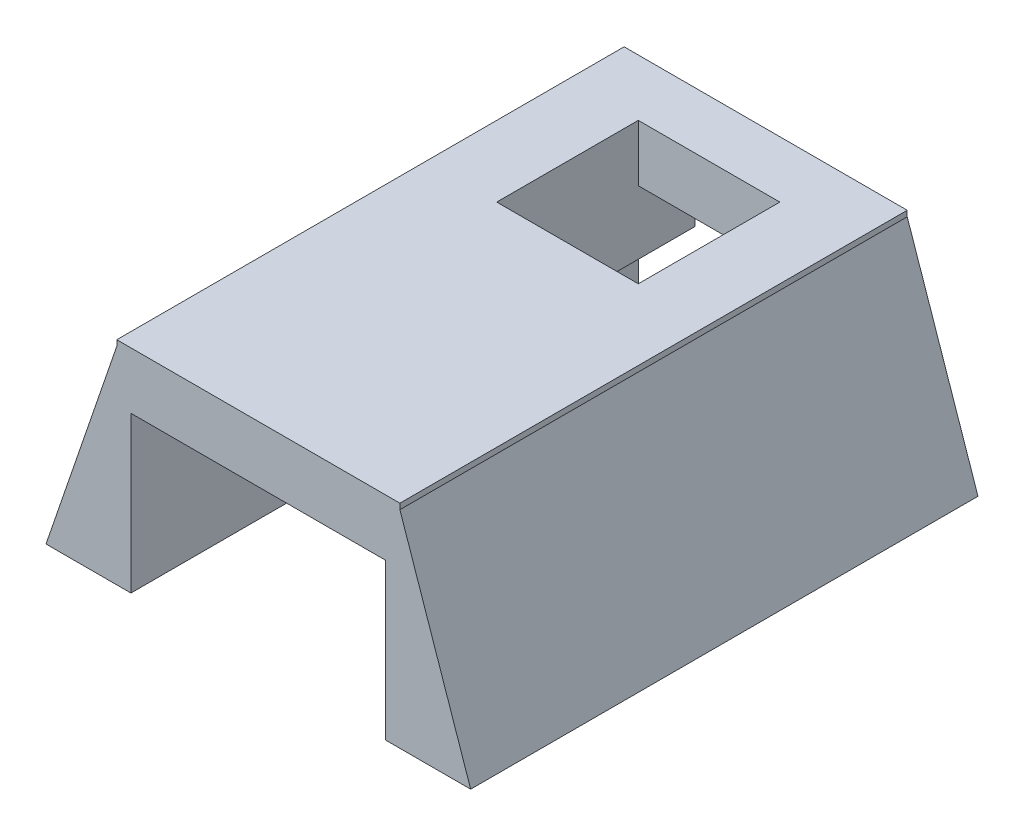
ISO-10303-21;
HEADER;
FILE_DESCRIPTION(('STEP AP214'),'2;1');
FILE_NAME('part.step','',(''),(''),'','','');
FILE_SCHEMA(('AUTOMOTIVE_DESIGN { 1 0 10303 214 1 1 1 1 }'));
ENDSEC;
DATA;
#1=APPLICATION_CONTEXT('core data for automotive mechanical design processes');
#2=APPLICATION_PROTOCOL_DEFINITION('international standard','automotive_design',2000,#1);
#3=PRODUCT_CONTEXT('',#1,'mechanical');
#4=PRODUCT('Part','Part','',(#3));
#5=PRODUCT_RELATED_PRODUCT_CATEGORY('part','',(#4));
#6=PRODUCT_DEFINITION_FORMATION('','',#4);
#7=PRODUCT_DEFINITION_CONTEXT('part definition',#1,'design');
#8=PRODUCT_DEFINITION('design','',#6,#7);
#9=PRODUCT_DEFINITION_SHAPE('','',#8);
#10=(LENGTH_UNIT() NAMED_UNIT(*) SI_UNIT(.MILLI.,.METRE.));
#11=(NAMED_UNIT(*) PLANE_ANGLE_UNIT() SI_UNIT($,.RADIAN.));
#12=(NAMED_UNIT(*) SI_UNIT($,.STERADIAN.) SOLID_ANGLE_UNIT());
#13=UNCERTAINTY_MEASURE_WITH_UNIT(LENGTH_MEASURE(1.E-05),#10,'distance_accuracy_value','');
#14=(GEOMETRIC_REPRESENTATION_CONTEXT(3) GLOBAL_UNCERTAINTY_ASSIGNED_CONTEXT((#13)) GLOBAL_UNIT_ASSIGNED_CONTEXT((#10,
#11,#12)) REPRESENTATION_CONTEXT('',''));
#15=CARTESIAN_POINT('',(0.,0.,0.));
#16=DIRECTION('',(0.,0.,1.));
#17=DIRECTION('',(1.,0.,0.));
#18=AXIS2_PLACEMENT_3D('',#15,#16,#17);
#19=CARTESIAN_POINT('',(-7.5,0.,19.92051609));
#20=DIRECTION('',(0.,1.,0.));
#21=DIRECTION('',(-1.,0.,0.));
#22=AXIS2_PLACEMENT_3D('',#19,#20,#21);
#23=PLANE('',#22);
#24=DIRECTION('',(0.,0.,-1.));
#25=VECTOR('',#24,1.);
#26=CARTESIAN_POINT('',(-7.5,0.,19.92051609));
#27=LINE('',#26,#25);
#28=CARTESIAN_POINT('',(-7.5,0.,19.92051609));
#29=VERTEX_POINT('',#28);
#30=CARTESIAN_POINT('',(-7.5,0.,2.));
#31=VERTEX_POINT('',#30);
#32=EDGE_CURVE('E197',#29,#31,#27,.T.);
#33=ORIENTED_EDGE('',*,*,#32,.T.);
#34=DIRECTION('',(-1.,0.,0.));
#35=VECTOR('',#34,1.);
#36=CARTESIAN_POINT('',(7.5,0.,2.));
#37=LINE('',#36,#35);
#38=CARTESIAN_POINT('',(-4.5,0.,2.));
#39=VERTEX_POINT('',#38);
#40=EDGE_CURVE('E178',#39,#31,#37,.T.);
#41=ORIENTED_EDGE('',*,*,#40,.F.);
#42=DIRECTION('',(0.,0.,1.));
#43=VECTOR('',#42,1.);
#44=CARTESIAN_POINT('',(-4.5,0.,11.));
#45=LINE('',#44,#43);
#46=CARTESIAN_POINT('',(-4.5,0.,19.92051609));
#47=VERTEX_POINT('',#46);
#48=EDGE_CURVE('E275',#39,#47,#45,.T.);
#49=ORIENTED_EDGE('',*,*,#48,.T.);
#50=DIRECTION('',(1.,0.,0.));
#51=VECTOR('',#50,1.);
#52=CARTESIAN_POINT('',(-7.5,0.,19.92051609));
#53=LINE('',#52,#51);
#54=EDGE_CURVE('E204',#29,#47,#53,.T.);
#55=ORIENTED_EDGE('',*,*,#54,.F.);
#56=EDGE_LOOP('',(#33,#41,#49,#55));
#57=FACE_BOUND('',#56,.T.);
#58=ADVANCED_FACE('F41',(#57),#23,.F.);
#59=CARTESIAN_POINT('',(0.,5.5,0.));
#60=DIRECTION('',(0.,-1.,0.));
#61=DIRECTION('',(1.,0.,0.));
#62=AXIS2_PLACEMENT_3D('',#59,#60,#61);
#63=PLANE('',#62);
#64=DIRECTION('',(1.,0.,0.));
#65=VECTOR('',#64,1.);
#66=CARTESIAN_POINT('',(0.,5.5,4.));
#67=LINE('',#66,#65);
#68=CARTESIAN_POINT('',(-2.5,5.5,4.));
#69=VERTEX_POINT('',#68);
#70=CARTESIAN_POINT('',(2.5,5.5,4.));
#71=VERTEX_POINT('',#70);
#72=EDGE_CURVE('E11',#69,#71,#67,.T.);
#73=ORIENTED_EDGE('',*,*,#72,.F.);
#74=DIRECTION('',(0.,0.,1.));
#75=VECTOR('',#74,1.);
#76=CARTESIAN_POINT('',(-2.5,5.5,11.));
#77=LINE('',#76,#75);
#78=CARTESIAN_POINT('',(-2.5,5.5,2.));
#79=VERTEX_POINT('',#78);
#80=EDGE_CURVE('E252',#79,#69,#77,.T.);
#81=ORIENTED_EDGE('',*,*,#80,.F.);
#82=DIRECTION('',(-1.,0.,0.));
#83=VECTOR('',#82,1.);
#84=CARTESIAN_POINT('',(0.,5.5,2.));
#85=LINE('',#84,#83);
#86=CARTESIAN_POINT('',(2.5,5.5,2.));
#87=VERTEX_POINT('',#86);
#88=EDGE_CURVE('E363',#87,#79,#85,.T.);
#89=ORIENTED_EDGE('',*,*,#88,.F.);
#90=DIRECTION('',(0.,0.,-1.));
#91=VECTOR('',#90,1.);
#92=CARTESIAN_POINT('',(2.5,5.5,11.));
#93=LINE('',#92,#91);
#94=EDGE_CURVE('E258',#71,#87,#93,.T.);
#95=ORIENTED_EDGE('',*,*,#94,.F.);
#96=EDGE_LOOP('',(#73,#81,#89,#95));
#97=FACE_BOUND('',#96,.T.);
#98=ADVANCED_FACE('F413',(#97),#63,.T.);
#99=CARTESIAN_POINT('',(-4.5,5.5,11.));
#100=DIRECTION('',(1.,0.,0.));
#101=DIRECTION('',(0.,0.,-1.));
#102=AXIS2_PLACEMENT_3D('',#99,#100,#101);
#103=PLANE('',#102);
#104=ORIENTED_EDGE('',*,*,#48,.F.);
#105=DIRECTION('',(0.,1.,0.));
#106=VECTOR('',#105,1.);
#107=CARTESIAN_POINT('',(-4.5,5.5,2.));
#108=LINE('',#107,#106);
#109=CARTESIAN_POINT('',(-4.5,3.25,2.));
#110=VERTEX_POINT('',#109);
#111=EDGE_CURVE('E184',#39,#110,#108,.T.);
#112=ORIENTED_EDGE('',*,*,#111,.T.);
#113=DIRECTION('',(0.,0.,-1.));
#114=VECTOR('',#113,1.);
#115=CARTESIAN_POINT('',(-4.5,3.25,19.92051609));
#116=LINE('',#115,#114);
#117=CARTESIAN_POINT('',(-4.5,3.25,11.));
#118=VERTEX_POINT('',#117);
#119=EDGE_CURVE('E375',#118,#110,#116,.T.);
#120=ORIENTED_EDGE('',*,*,#119,.F.);
#121=DIRECTION('',(0.,-1.,0.));
#122=VECTOR('',#121,1.);
#123=CARTESIAN_POINT('',(-4.5,5.5,11.));
#124=LINE('',#123,#122);
#125=CARTESIAN_POINT('',(-4.5,5.5,11.));
#126=VERTEX_POINT('',#125);
#127=EDGE_CURVE('E294',#126,#118,#124,.T.);
#128=ORIENTED_EDGE('',*,*,#127,.F.);
#129=DIRECTION('',(0.,0.,1.));
#130=VECTOR('',#129,1.);
#131=CARTESIAN_POINT('',(-4.5,5.5,11.));
#132=LINE('',#131,#130);
#133=CARTESIAN_POINT('',(-4.5,5.5,19.92051609));
#134=VERTEX_POINT('',#133);
#135=EDGE_CURVE('E264',#126,#134,#132,.T.);
#136=ORIENTED_EDGE('',*,*,#135,.T.);
#137=DIRECTION('',(0.,-1.,0.));
#138=VECTOR('',#137,1.);
#139=CARTESIAN_POINT('',(-4.5,5.5,19.92051609));
#140=LINE('',#139,#138);
#141=EDGE_CURVE('E290',#134,#47,#140,.T.);
#142=ORIENTED_EDGE('',*,*,#141,.T.);
#143=EDGE_LOOP('',(#104,#112,#120,#128,#136,#142));
#144=FACE_BOUND('',#143,.T.);
#145=ADVANCED_FACE('F424',(#144),#103,.T.);
#146=CARTESIAN_POINT('',(4.5,5.5,11.));
#147=DIRECTION('',(-1.,0.,0.));
#148=DIRECTION('',(0.,0.,1.));
#149=AXIS2_PLACEMENT_3D('',#146,#147,#148);
#150=PLANE('',#149);
#151=DIRECTION('',(0.,0.,-1.));
#152=VECTOR('',#151,1.);
#153=CARTESIAN_POINT('',(4.5,3.25,19.92051609));
#154=LINE('',#153,#152);
#155=CARTESIAN_POINT('',(4.5,3.25,11.));
#156=VERTEX_POINT('',#155);
#157=CARTESIAN_POINT('',(4.5,3.25,2.));
#158=VERTEX_POINT('',#157);
#159=EDGE_CURVE('E376',#156,#158,#154,.T.);
#160=ORIENTED_EDGE('',*,*,#159,.T.);
#161=DIRECTION('',(0.,-1.,0.));
#162=VECTOR('',#161,1.);
#163=CARTESIAN_POINT('',(4.5,5.5,2.));
#164=LINE('',#163,#162);
#165=CARTESIAN_POINT('',(4.5,0.,2.));
#166=VERTEX_POINT('',#165);
#167=EDGE_CURVE('E369',#158,#166,#164,.T.);
#168=ORIENTED_EDGE('',*,*,#167,.T.);
#169=DIRECTION('',(0.,0.,-1.));
#170=VECTOR('',#169,1.);
#171=CARTESIAN_POINT('',(4.5,0.,11.));
#172=LINE('',#171,#170);
#173=CARTESIAN_POINT('',(4.5,0.,19.92051609));
#174=VERTEX_POINT('',#173);
#175=EDGE_CURVE('E278',#174,#166,#172,.T.);
#176=ORIENTED_EDGE('',*,*,#175,.F.);
#177=DIRECTION('',(0.,-1.,0.));
#178=VECTOR('',#177,1.);
#179=CARTESIAN_POINT('',(4.5,5.5,19.92051609));
#180=LINE('',#179,#178);
#181=CARTESIAN_POINT('',(4.5,5.5,19.92051609));
#182=VERTEX_POINT('',#181);
#183=EDGE_CURVE('E287',#182,#174,#180,.T.);
#184=ORIENTED_EDGE('',*,*,#183,.F.);
#185=DIRECTION('',(0.,0.,-1.));
#186=VECTOR('',#185,1.);
#187=CARTESIAN_POINT('',(4.5,5.5,11.));
#188=LINE('',#187,#186);
#189=CARTESIAN_POINT('',(4.5,5.5,11.));
#190=VERTEX_POINT('',#189);
#191=EDGE_CURVE('E271',#182,#190,#188,.T.);
#192=ORIENTED_EDGE('',*,*,#191,.T.);
#193=DIRECTION('',(0.,-1.,0.));
#194=VECTOR('',#193,1.);
#195=CARTESIAN_POINT('',(4.5,5.5,11.));
#196=LINE('',#195,#194);
#197=EDGE_CURVE('E274',#190,#156,#196,.T.);
#198=ORIENTED_EDGE('',*,*,#197,.T.);
#199=EDGE_LOOP('',(#160,#168,#176,#184,#192,#198));
#200=FACE_BOUND('',#199,.T.);
#201=ADVANCED_FACE('F432',(#200),#150,.T.);
#202=CARTESIAN_POINT('',(4.5,3.25,19.92051609));
#203=DIRECTION('',(0.,1.,0.));
#204=DIRECTION('',(0.,0.,1.));
#205=AXIS2_PLACEMENT_3D('',#202,#203,#204);
#206=PLANE('',#205);
#207=DIRECTION('',(-1.,0.,0.));
#208=VECTOR('',#207,1.);
#209=CARTESIAN_POINT('',(-6.,3.25,2.));
#210=LINE('',#209,#208);
#211=CARTESIAN_POINT('',(-2.5,3.25,2.));
#212=VERTEX_POINT('',#211);
#213=EDGE_CURVE('E366',#212,#110,#210,.T.);
#214=ORIENTED_EDGE('',*,*,#213,.F.);
#215=DIRECTION('',(0.,0.,1.));
#216=VECTOR('',#215,1.);
#217=CARTESIAN_POINT('',(-2.5,3.25,11.));
#218=LINE('',#217,#216);
#219=CARTESIAN_POINT('',(-2.5,3.25,11.));
#220=VERTEX_POINT('',#219);
#221=EDGE_CURVE('E387',#212,#220,#218,.T.);
#222=ORIENTED_EDGE('',*,*,#221,.T.);
#223=DIRECTION('',(-1.,0.,0.));
#224=VECTOR('',#223,1.);
#225=CARTESIAN_POINT('',(-2.5,3.25,11.));
#226=LINE('',#225,#224);
#227=EDGE_CURVE('E380',#220,#118,#226,.T.);
#228=ORIENTED_EDGE('',*,*,#227,.T.);
#229=ORIENTED_EDGE('',*,*,#119,.T.);
#230=EDGE_LOOP('',(#214,#222,#228,#229));
#231=FACE_BOUND('',#230,.T.);
#232=ADVANCED_FACE('F419',(#231),#206,.F.);
#233=DIRECTION('',(-1.,0.,0.));
#234=VECTOR('',#233,1.);
#235=CARTESIAN_POINT('',(4.5,3.25,2.));
#236=LINE('',#235,#234);
#237=CARTESIAN_POINT('',(2.5,3.25,2.));
#238=VERTEX_POINT('',#237);
#239=EDGE_CURVE('E231',#158,#238,#236,.T.);
#240=ORIENTED_EDGE('',*,*,#239,.F.);
#241=ORIENTED_EDGE('',*,*,#159,.F.);
#242=DIRECTION('',(-1.,0.,0.));
#243=VECTOR('',#242,1.);
#244=CARTESIAN_POINT('',(2.5,3.25,11.));
#245=LINE('',#244,#243);
#246=CARTESIAN_POINT('',(2.5,3.25,11.));
#247=VERTEX_POINT('',#246);
#248=EDGE_CURVE('E279',#156,#247,#245,.T.);
#249=ORIENTED_EDGE('',*,*,#248,.T.);
#250=DIRECTION('',(0.,0.,-1.));
#251=VECTOR('',#250,1.);
#252=CARTESIAN_POINT('',(2.5,3.25,11.));
#253=LINE('',#252,#251);
#254=EDGE_CURVE('E390',#247,#238,#253,.T.);
#255=ORIENTED_EDGE('',*,*,#254,.T.);
#256=EDGE_LOOP('',(#240,#241,#249,#255));
#257=FACE_BOUND('',#256,.T.);
#258=ADVANCED_FACE('F451',(#257),#206,.F.);
#259=ORIENTED_EDGE('',*,*,#175,.T.);
#260=CARTESIAN_POINT('',(7.5,0.,2.));
#261=VERTEX_POINT('',#260);
#262=EDGE_CURVE('E189',#261,#166,#37,.T.);
#263=ORIENTED_EDGE('',*,*,#262,.F.);
#264=DIRECTION('',(0.,0.,-1.));
#265=VECTOR('',#264,1.);
#266=CARTESIAN_POINT('',(7.5,0.,19.92051609));
#267=LINE('',#266,#265);
#268=CARTESIAN_POINT('',(7.5,0.,19.92051609));
#269=VERTEX_POINT('',#268);
#270=EDGE_CURVE('E227',#269,#261,#267,.T.);
#271=ORIENTED_EDGE('',*,*,#270,.F.);
#272=EDGE_CURVE('E305',#174,#269,#53,.T.);
#273=ORIENTED_EDGE('',*,*,#272,.F.);
#274=EDGE_LOOP('',(#259,#263,#271,#273));
#275=FACE_BOUND('',#274,.T.);
#276=ADVANCED_FACE('F43',(#275),#23,.F.);
#277=CARTESIAN_POINT('',(0.,0.,19.92051609));
#278=DIRECTION('',(0.,0.,1.));
#279=DIRECTION('',(1.,0.,0.));
#280=AXIS2_PLACEMENT_3D('',#277,#278,#279);
#281=PLANE('',#280);
#282=ORIENTED_EDGE('',*,*,#54,.T.);
#283=ORIENTED_EDGE('',*,*,#141,.F.);
#284=DIRECTION('',(1.,0.,0.));
#285=VECTOR('',#284,1.);
#286=CARTESIAN_POINT('',(-4.5,5.5,19.92051609));
#287=LINE('',#286,#285);
#288=EDGE_CURVE('E267',#134,#182,#287,.T.);
#289=ORIENTED_EDGE('',*,*,#288,.T.);
#290=ORIENTED_EDGE('',*,*,#183,.T.);
#291=ORIENTED_EDGE('',*,*,#272,.T.);
#292=DIRECTION('',(-0.32399297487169,0.946059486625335,0.));
#293=VECTOR('',#292,1.);
#294=CARTESIAN_POINT('',(7.5,0.,19.92051609));
#295=LINE('',#294,#293);
#296=CARTESIAN_POINT('',(5.,7.3,19.92051609));
#297=VERTEX_POINT('',#296);
#298=EDGE_CURVE('E308',#269,#297,#295,.T.);
#299=ORIENTED_EDGE('',*,*,#298,.T.);
#300=DIRECTION('',(0.,1.,0.));
#301=VECTOR('',#300,1.);
#302=CARTESIAN_POINT('',(5.,7.3,19.92051609));
#303=LINE('',#302,#301);
#304=CARTESIAN_POINT('',(5.,7.5,19.92051609));
#305=VERTEX_POINT('',#304);
#306=EDGE_CURVE('E311',#297,#305,#303,.T.);
#307=ORIENTED_EDGE('',*,*,#306,.T.);
#308=DIRECTION('',(-1.,0.,0.));
#309=VECTOR('',#308,1.);
#310=CARTESIAN_POINT('',(-5.,7.5,19.92051609));
#311=LINE('',#310,#309);
#312=CARTESIAN_POINT('',(-5.,7.5,19.92051609));
#313=VERTEX_POINT('',#312);
#314=EDGE_CURVE('E314',#305,#313,#311,.T.);
#315=ORIENTED_EDGE('',*,*,#314,.T.);
#316=DIRECTION('',(0.,-1.,0.));
#317=VECTOR('',#316,1.);
#318=CARTESIAN_POINT('',(-5.,7.3,19.92051609));
#319=LINE('',#318,#317);
#320=CARTESIAN_POINT('',(-5.,7.3,19.92051609));
#321=VERTEX_POINT('',#320);
#322=EDGE_CURVE('E212',#313,#321,#319,.T.);
#323=ORIENTED_EDGE('',*,*,#322,.T.);
#324=DIRECTION('',(-0.32399297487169,-0.946059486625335,0.));
#325=VECTOR('',#324,1.);
#326=CARTESIAN_POINT('',(-7.5,0.,19.92051609));
#327=LINE('',#326,#325);
#328=EDGE_CURVE('E206',#321,#29,#327,.T.);
#329=ORIENTED_EDGE('',*,*,#328,.T.);
#330=EDGE_LOOP('',(#282,#283,#289,#290,#291,#299,#307,#315,#323,#329));
#331=FACE_BOUND('',#330,.T.);
#332=ADVANCED_FACE('F319',(#331),#281,.T.);
#333=CARTESIAN_POINT('',(7.5,0.,19.92051609));
#334=DIRECTION('',(-0.946059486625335,-0.32399297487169,0.));
#335=DIRECTION('',(0.32399297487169,-0.946059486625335,0.));
#336=AXIS2_PLACEMENT_3D('',#333,#334,#335);
#337=PLANE('',#336);
#338=ORIENTED_EDGE('',*,*,#270,.T.);
#339=DIRECTION('',(0.32399297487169,-0.946059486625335,0.));
#340=VECTOR('',#339,1.);
#341=CARTESIAN_POINT('',(5.20081877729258,6.71360917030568,2.));
#342=LINE('',#341,#340);
#343=CARTESIAN_POINT('',(5.,7.3,2.));
#344=VERTEX_POINT('',#343);
#345=EDGE_CURVE('E190',#344,#261,#342,.T.);
#346=ORIENTED_EDGE('',*,*,#345,.F.);
#347=DIRECTION('',(0.,0.,-1.));
#348=VECTOR('',#347,1.);
#349=CARTESIAN_POINT('',(5.,7.3,19.92051609));
#350=LINE('',#349,#348);
#351=EDGE_CURVE('E223',#297,#344,#350,.T.);
#352=ORIENTED_EDGE('',*,*,#351,.F.);
#353=ORIENTED_EDGE('',*,*,#298,.F.);
#354=EDGE_LOOP('',(#338,#346,#352,#353));
#355=FACE_BOUND('',#354,.T.);
#356=ADVANCED_FACE('F439',(#355),#337,.F.);
#357=CARTESIAN_POINT('',(5.,7.3,19.92051609));
#358=DIRECTION('',(-1.,0.,0.));
#359=DIRECTION('',(0.,0.,1.));
#360=AXIS2_PLACEMENT_3D('',#357,#358,#359);
#361=PLANE('',#360);
#362=ORIENTED_EDGE('',*,*,#351,.T.);
#363=DIRECTION('',(0.,-1.,0.));
#364=VECTOR('',#363,1.);
#365=CARTESIAN_POINT('',(5.,7.501,2.));
#366=LINE('',#365,#364);
#367=CARTESIAN_POINT('',(5.,7.5,2.));
#368=VERTEX_POINT('',#367);
#369=EDGE_CURVE('E331',#368,#344,#366,.T.);
#370=ORIENTED_EDGE('',*,*,#369,.F.);
#371=DIRECTION('',(0.,0.,-1.));
#372=VECTOR('',#371,1.);
#373=CARTESIAN_POINT('',(5.,7.5,19.92051609));
#374=LINE('',#373,#372);
#375=EDGE_CURVE('E219',#305,#368,#374,.T.);
#376=ORIENTED_EDGE('',*,*,#375,.F.);
#377=ORIENTED_EDGE('',*,*,#306,.F.);
#378=EDGE_LOOP('',(#362,#370,#376,#377));
#379=FACE_BOUND('',#378,.T.);
#380=ADVANCED_FACE('F445',(#379),#361,.F.);
#381=CARTESIAN_POINT('',(-5.,7.5,19.92051609));
#382=DIRECTION('',(0.,-1.,0.));
#383=DIRECTION('',(1.,0.,0.));
#384=AXIS2_PLACEMENT_3D('',#381,#382,#383);
#385=PLANE('',#384);
#386=DIRECTION('',(1.,0.,0.));
#387=VECTOR('',#386,1.);
#388=CARTESIAN_POINT('',(2.5,7.5,9.));
#389=LINE('',#388,#387);
#390=CARTESIAN_POINT('',(-2.5,7.5,9.));
#391=VERTEX_POINT('',#390);
#392=CARTESIAN_POINT('',(2.5,7.5,9.));
#393=VERTEX_POINT('',#392);
#394=EDGE_CURVE('E339',#391,#393,#389,.T.);
#395=ORIENTED_EDGE('',*,*,#394,.F.);
#396=DIRECTION('',(0.,0.,1.));
#397=VECTOR('',#396,1.);
#398=CARTESIAN_POINT('',(-2.5,7.5,9.));
#399=LINE('',#398,#397);
#400=CARTESIAN_POINT('',(-2.5,7.5,4.));
#401=VERTEX_POINT('',#400);
#402=EDGE_CURVE('E57',#401,#391,#399,.T.);
#403=ORIENTED_EDGE('',*,*,#402,.F.);
#404=DIRECTION('',(-1.,0.,0.));
#405=VECTOR('',#404,1.);
#406=CARTESIAN_POINT('',(2.5,7.5,4.));
#407=LINE('',#406,#405);
#408=CARTESIAN_POINT('',(2.5,7.5,4.));
#409=VERTEX_POINT('',#408);
#410=EDGE_CURVE('E245',#409,#401,#407,.T.);
#411=ORIENTED_EDGE('',*,*,#410,.F.);
#412=DIRECTION('',(0.,0.,-1.));
#413=VECTOR('',#412,1.);
#414=CARTESIAN_POINT('',(2.5,7.5,9.));
#415=LINE('',#414,#413);
#416=EDGE_CURVE('E342',#393,#409,#415,.T.);
#417=ORIENTED_EDGE('',*,*,#416,.F.);
#418=EDGE_LOOP('',(#395,#403,#411,#417));
#419=FACE_BOUND('',#418,.T.);
#420=ORIENTED_EDGE('',*,*,#375,.T.);
#421=DIRECTION('',(1.,0.,0.));
#422=VECTOR('',#421,1.);
#423=CARTESIAN_POINT('',(7.5,7.5,2.));
#424=LINE('',#423,#422);
#425=CARTESIAN_POINT('',(-5.,7.5,2.));
#426=VERTEX_POINT('',#425);
#427=EDGE_CURVE('E327',#426,#368,#424,.T.);
#428=ORIENTED_EDGE('',*,*,#427,.F.);
#429=DIRECTION('',(0.,0.,-1.));
#430=VECTOR('',#429,1.);
#431=CARTESIAN_POINT('',(-5.,7.5,19.92051609));
#432=LINE('',#431,#430);
#433=EDGE_CURVE('E210',#313,#426,#432,.T.);
#434=ORIENTED_EDGE('',*,*,#433,.F.);
#435=ORIENTED_EDGE('',*,*,#314,.F.);
#436=EDGE_LOOP('',(#420,#428,#434,#435));
#437=FACE_BOUND('',#436,.T.);
#438=ADVANCED_FACE('F447',(#419,#437),#385,.F.);
#439=CARTESIAN_POINT('',(-5.,7.3,19.92051609));
#440=DIRECTION('',(1.,0.,0.));
#441=DIRECTION('',(0.,0.,-1.));
#442=AXIS2_PLACEMENT_3D('',#439,#440,#441);
#443=PLANE('',#442);
#444=ORIENTED_EDGE('',*,*,#433,.T.);
#445=DIRECTION('',(0.,1.,0.));
#446=VECTOR('',#445,1.);
#447=CARTESIAN_POINT('',(-5.,7.501,2.));
#448=LINE('',#447,#446);
#449=CARTESIAN_POINT('',(-5.,7.3,2.));
#450=VERTEX_POINT('',#449);
#451=EDGE_CURVE('E324',#450,#426,#448,.T.);
#452=ORIENTED_EDGE('',*,*,#451,.F.);
#453=DIRECTION('',(0.,0.,-1.));
#454=VECTOR('',#453,1.);
#455=CARTESIAN_POINT('',(-5.,7.3,19.92051609));
#456=LINE('',#455,#454);
#457=EDGE_CURVE('E200',#321,#450,#456,.T.);
#458=ORIENTED_EDGE('',*,*,#457,.F.);
#459=ORIENTED_EDGE('',*,*,#322,.F.);
#460=EDGE_LOOP('',(#444,#452,#458,#459));
#461=FACE_BOUND('',#460,.T.);
#462=ADVANCED_FACE('F323',(#461),#443,.F.);
#463=CARTESIAN_POINT('',(-7.5,0.,19.92051609));
#464=DIRECTION('',(0.946059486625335,-0.32399297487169,0.));
#465=DIRECTION('',(0.32399297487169,0.946059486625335,0.));
#466=AXIS2_PLACEMENT_3D('',#463,#464,#465);
#467=PLANE('',#466);
#468=ORIENTED_EDGE('',*,*,#457,.T.);
#469=DIRECTION('',(0.32399297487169,0.946059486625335,0.));
#470=VECTOR('',#469,1.);
#471=CARTESIAN_POINT('',(-3.62624706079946,11.3113585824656,2.));
#472=LINE('',#471,#470);
#473=EDGE_CURVE('E181',#31,#450,#472,.T.);
#474=ORIENTED_EDGE('',*,*,#473,.F.);
#475=ORIENTED_EDGE('',*,*,#32,.F.);
#476=ORIENTED_EDGE('',*,*,#328,.F.);
#477=EDGE_LOOP('',(#468,#474,#475,#476));
#478=FACE_BOUND('',#477,.T.);
#479=ADVANCED_FACE('F195',(#478),#467,.F.);
#480=CARTESIAN_POINT('',(2.5,5.5,11.));
#481=DIRECTION('',(0.,0.,1.));
#482=DIRECTION('',(1.,0.,0.));
#483=AXIS2_PLACEMENT_3D('',#480,#481,#482);
#484=PLANE('',#483);
#485=ORIENTED_EDGE('',*,*,#248,.F.);
#486=ORIENTED_EDGE('',*,*,#197,.F.);
#487=DIRECTION('',(-1.,0.,0.));
#488=VECTOR('',#487,1.);
#489=CARTESIAN_POINT('',(2.5,5.5,11.));
#490=LINE('',#489,#488);
#491=CARTESIAN_POINT('',(2.5,5.5,11.));
#492=VERTEX_POINT('',#491);
#493=EDGE_CURVE('E283',#190,#492,#490,.T.);
#494=ORIENTED_EDGE('',*,*,#493,.T.);
#495=DIRECTION('',(0.,-1.,0.));
#496=VECTOR('',#495,1.);
#497=CARTESIAN_POINT('',(2.5,5.5,11.));
#498=LINE('',#497,#496);
#499=EDGE_CURVE('E301',#492,#247,#498,.T.);
#500=ORIENTED_EDGE('',*,*,#499,.T.);
#501=EDGE_LOOP('',(#485,#486,#494,#500));
#502=FACE_BOUND('',#501,.T.);
#503=ADVANCED_FACE('F453',(#502),#484,.T.);
#504=CARTESIAN_POINT('',(2.5,5.5,11.));
#505=DIRECTION('',(-1.,0.,0.));
#506=DIRECTION('',(0.,-1.,0.));
#507=AXIS2_PLACEMENT_3D('',#504,#505,#506);
#508=PLANE('',#507);
#509=CARTESIAN_POINT('',(2.5,5.5,9.));
#510=VERTEX_POINT('',#509);
#511=EDGE_CURVE('E253',#492,#510,#93,.T.);
#512=ORIENTED_EDGE('',*,*,#511,.T.);
#513=DIRECTION('',(0.,1.,0.));
#514=VECTOR('',#513,1.);
#515=CARTESIAN_POINT('',(2.5,0.,9.));
#516=LINE('',#515,#514);
#517=EDGE_CURVE('E65',#510,#393,#516,.T.);
#518=ORIENTED_EDGE('',*,*,#517,.T.);
#519=ORIENTED_EDGE('',*,*,#416,.T.);
#520=DIRECTION('',(0.,1.,0.));
#521=VECTOR('',#520,1.);
#522=CARTESIAN_POINT('',(2.5,0.,4.));
#523=LINE('',#522,#521);
#524=EDGE_CURVE('E353',#71,#409,#523,.T.);
#525=ORIENTED_EDGE('',*,*,#524,.F.);
#526=ORIENTED_EDGE('',*,*,#94,.T.);
#527=DIRECTION('',(0.,1.,0.));
#528=VECTOR('',#527,1.);
#529=CARTESIAN_POINT('',(2.5,5.5,2.));
#530=LINE('',#529,#528);
#531=EDGE_CURVE('E360',#238,#87,#530,.T.);
#532=ORIENTED_EDGE('',*,*,#531,.F.);
#533=ORIENTED_EDGE('',*,*,#254,.F.);
#534=ORIENTED_EDGE('',*,*,#499,.F.);
#535=EDGE_LOOP('',(#512,#518,#519,#525,#526,#532,#533,#534));
#536=FACE_BOUND('',#535,.T.);
#537=ADVANCED_FACE('F408',(#536),#508,.T.);
#538=CARTESIAN_POINT('',(-2.5,5.5,11.));
#539=DIRECTION('',(1.,0.,0.));
#540=DIRECTION('',(0.,1.,0.));
#541=AXIS2_PLACEMENT_3D('',#538,#539,#540);
#542=PLANE('',#541);
#543=DIRECTION('',(0.,-1.,0.));
#544=VECTOR('',#543,1.);
#545=CARTESIAN_POINT('',(-2.5,5.5,11.));
#546=LINE('',#545,#544);
#547=CARTESIAN_POINT('',(-2.5,5.5,11.));
#548=VERTEX_POINT('',#547);
#549=EDGE_CURVE('E298',#548,#220,#546,.T.);
#550=ORIENTED_EDGE('',*,*,#549,.T.);
#551=ORIENTED_EDGE('',*,*,#221,.F.);
#552=DIRECTION('',(0.,-1.,0.));
#553=VECTOR('',#552,1.);
#554=CARTESIAN_POINT('',(-2.5,5.5,2.));
#555=LINE('',#554,#553);
#556=EDGE_CURVE('E352',#79,#212,#555,.T.);
#557=ORIENTED_EDGE('',*,*,#556,.F.);
#558=ORIENTED_EDGE('',*,*,#80,.T.);
#559=DIRECTION('',(0.,1.,0.));
#560=VECTOR('',#559,1.);
#561=CARTESIAN_POINT('',(-2.5,0.,4.));
#562=LINE('',#561,#560);
#563=EDGE_CURVE('E349',#69,#401,#562,.T.);
#564=ORIENTED_EDGE('',*,*,#563,.T.);
#565=ORIENTED_EDGE('',*,*,#402,.T.);
#566=DIRECTION('',(0.,1.,0.));
#567=VECTOR('',#566,1.);
#568=CARTESIAN_POINT('',(-2.5,0.,9.));
#569=LINE('',#568,#567);
#570=CARTESIAN_POINT('',(-2.5,5.5,9.));
#571=VERTEX_POINT('',#570);
#572=EDGE_CURVE('E235',#571,#391,#569,.T.);
#573=ORIENTED_EDGE('',*,*,#572,.F.);
#574=EDGE_CURVE('E242',#571,#548,#77,.T.);
#575=ORIENTED_EDGE('',*,*,#574,.T.);
#576=EDGE_LOOP('',(#550,#551,#557,#558,#564,#565,#573,#575));
#577=FACE_BOUND('',#576,.T.);
#578=ADVANCED_FACE('F241',(#577),#542,.T.);
#579=CARTESIAN_POINT('',(-2.5,5.5,11.));
#580=DIRECTION('',(0.,0.,1.));
#581=DIRECTION('',(1.,0.,0.));
#582=AXIS2_PLACEMENT_3D('',#579,#580,#581);
#583=PLANE('',#582);
#584=ORIENTED_EDGE('',*,*,#227,.F.);
#585=ORIENTED_EDGE('',*,*,#549,.F.);
#586=DIRECTION('',(-1.,0.,0.));
#587=VECTOR('',#586,1.);
#588=CARTESIAN_POINT('',(-2.5,5.5,11.));
#589=LINE('',#588,#587);
#590=EDGE_CURVE('E250',#548,#126,#589,.T.);
#591=ORIENTED_EDGE('',*,*,#590,.T.);
#592=ORIENTED_EDGE('',*,*,#127,.T.);
#593=EDGE_LOOP('',(#584,#585,#591,#592));
#594=FACE_BOUND('',#593,.T.);
#595=ADVANCED_FACE('F421',(#594),#583,.T.);
#596=DIRECTION('',(-1.,0.,0.));
#597=VECTOR('',#596,1.);
#598=CARTESIAN_POINT('',(0.,5.5,9.));
#599=LINE('',#598,#597);
#600=EDGE_CURVE('E50',#510,#571,#599,.T.);
#601=ORIENTED_EDGE('',*,*,#600,.F.);
#602=ORIENTED_EDGE('',*,*,#511,.F.);
#603=ORIENTED_EDGE('',*,*,#493,.F.);
#604=ORIENTED_EDGE('',*,*,#191,.F.);
#605=ORIENTED_EDGE('',*,*,#288,.F.);
#606=ORIENTED_EDGE('',*,*,#135,.F.);
#607=ORIENTED_EDGE('',*,*,#590,.F.);
#608=ORIENTED_EDGE('',*,*,#574,.F.);
#609=EDGE_LOOP('',(#601,#602,#603,#604,#605,#606,#607,#608));
#610=FACE_BOUND('',#609,.T.);
#611=ADVANCED_FACE('F248',(#610),#63,.T.);
#612=CARTESIAN_POINT('',(2.5,0.,4.));
#613=DIRECTION('',(0.,0.,-1.));
#614=DIRECTION('',(-1.,0.,0.));
#615=AXIS2_PLACEMENT_3D('',#612,#613,#614);
#616=PLANE('',#615);
#617=ORIENTED_EDGE('',*,*,#72,.T.);
#618=ORIENTED_EDGE('',*,*,#524,.T.);
#619=ORIENTED_EDGE('',*,*,#410,.T.);
#620=ORIENTED_EDGE('',*,*,#563,.F.);
#621=EDGE_LOOP('',(#617,#618,#619,#620));
#622=FACE_BOUND('',#621,.T.);
#623=ADVANCED_FACE('F458',(#622),#616,.F.);
#624=CARTESIAN_POINT('',(2.5,0.,9.));
#625=DIRECTION('',(0.,0.,1.));
#626=DIRECTION('',(1.,0.,0.));
#627=AXIS2_PLACEMENT_3D('',#624,#625,#626);
#628=PLANE('',#627);
#629=ORIENTED_EDGE('',*,*,#600,.T.);
#630=ORIENTED_EDGE('',*,*,#572,.T.);
#631=ORIENTED_EDGE('',*,*,#394,.T.);
#632=ORIENTED_EDGE('',*,*,#517,.F.);
#633=EDGE_LOOP('',(#629,#630,#631,#632));
#634=FACE_BOUND('',#633,.T.);
#635=ADVANCED_FACE('F234',(#634),#628,.F.);
#636=CARTESIAN_POINT('',(7.5,7.501,2.));
#637=DIRECTION('',(0.,0.,1.));
#638=DIRECTION('',(1.,0.,0.));
#639=AXIS2_PLACEMENT_3D('',#636,#637,#638);
#640=PLANE('',#639);
#641=ORIENTED_EDGE('',*,*,#167,.F.);
#642=ORIENTED_EDGE('',*,*,#239,.T.);
#643=ORIENTED_EDGE('',*,*,#531,.T.);
#644=ORIENTED_EDGE('',*,*,#88,.T.);
#645=ORIENTED_EDGE('',*,*,#556,.T.);
#646=ORIENTED_EDGE('',*,*,#213,.T.);
#647=ORIENTED_EDGE('',*,*,#111,.F.);
#648=ORIENTED_EDGE('',*,*,#40,.T.);
#649=ORIENTED_EDGE('',*,*,#473,.T.);
#650=ORIENTED_EDGE('',*,*,#451,.T.);
#651=ORIENTED_EDGE('',*,*,#427,.T.);
#652=ORIENTED_EDGE('',*,*,#369,.T.);
#653=ORIENTED_EDGE('',*,*,#345,.T.);
#654=ORIENTED_EDGE('',*,*,#262,.T.);
#655=EDGE_LOOP('',(#641,#642,#643,#644,#645,#646,#647,#648,#649,#650,#651,#652,#653,#654));
#656=FACE_BOUND('',#655,.T.);
#657=ADVANCED_FACE('F180',(#656),#640,.F.);
#658=CLOSED_SHELL('',(#58,#98,#145,#201,#232,#258,#276,#332,#356,#380,#438,#462,#479,#503,#537,
#578,#595,#611,#623,#635,#657));
#659=MANIFOLD_SOLID_BREP('B2',#658);
#660=ADVANCED_BREP_SHAPE_REPRESENTATION('',(#18,#659),#14);
#661=SHAPE_DEFINITION_REPRESENTATION(#9,#660);
ENDSEC;
END-ISO-10303-21;
